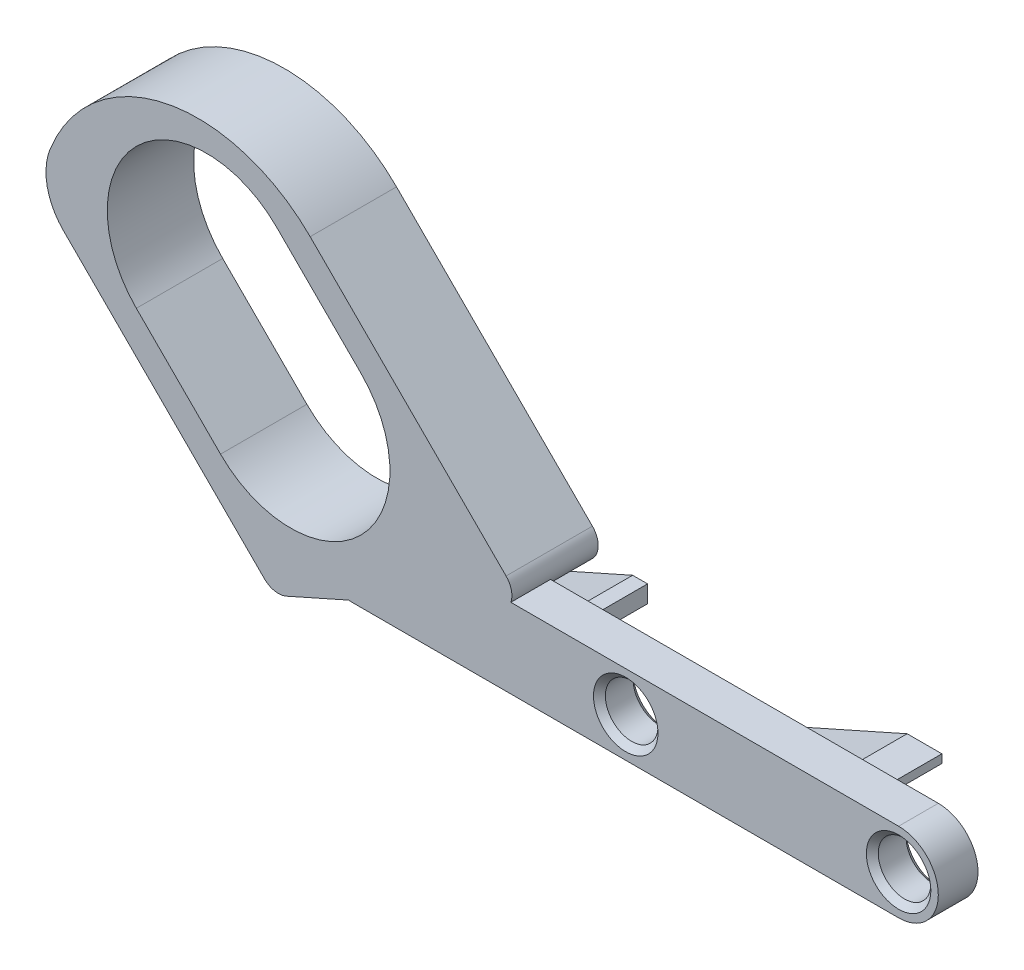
from build123d import *

# Parameters (mm, degrees)
BOSS_EXTRUDE1_DEPTH                      = 4
SKETCH2_R                                = 2.65
CUT_EXTRUDE1_DEPTH                       = 33.003906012
CHAMFER4_SIZE                            = 0.6
CHAMFER5_SIZE                            = 0.6
CHAMFER6_SIZE                            = 0.6
CHAMFER7_SIZE                            = 0.6
BOSS_EXTRUDE2_DEPTH                      = 4.7
MIRROR1_AT_THE_SECOND_PLANE_COPY_1_DEPTH = 4.7
CUT_EXTRUDE2_DEPTH                       = 4.7
BOSS_EXTRUDE3_START                      = -4.7
BOSS_EXTRUDE3_DEPTH                      = 8.7
SKETCH10_R                               = 10
CUT_EXTRUDE3_DEPTH                       = 8.7


with BuildPart() as part:
    # Sketch1 → Boss-Extrude1 (new body)
    with BuildSketch(Plane.XY):
        with BuildLine():
            Line((-27.5, 4), (27.5, 4))
            ThreePointArc((27.5, 4), (31.5, 0), (27.5, -4))
            Line((27.5, -4), (-27.5, -4))
            ThreePointArc((-27.5, -4), (-31.5, 0), (-27.5, 4))
        make_face()
    extrude(amount=BOSS_EXTRUDE1_DEPTH)

    # Sketch2 → Cut-Extrude1 (cut, through all)
    with BuildSketch(Plane.XY.offset(4)):
        Circle(SKETCH2_R)
        with Locations((27.5, 0)):
            Circle(SKETCH2_R)
    extrude(amount=-CUT_EXTRUDE1_DEPTH, mode=Mode.SUBTRACT)

    # Chamfer4
    chamfer4_edges = [part.edges().sort_by_distance(p)[0] for p in [
        (-2.65, 0, 0),
    ]]
    chamfer(chamfer4_edges, length=CHAMFER4_SIZE)

    # Chamfer5
    chamfer5_edges = [part.edges().sort_by_distance(p)[0] for p in [
        (-2.65, 0, 4),
    ]]
    chamfer(chamfer5_edges, length=CHAMFER5_SIZE)

    # Chamfer6
    chamfer6_edges = [part.edges().sort_by_distance(p)[0] for p in [
        (24.85, 0, 0),
    ]]
    chamfer(chamfer6_edges, length=CHAMFER6_SIZE)

    # Chamfer7
    chamfer7_edges = [part.edges().sort_by_distance(p)[0] for p in [
        (24.85, 0, 4),
    ]]
    chamfer(chamfer7_edges, length=CHAMFER7_SIZE)

    # Sketch5 → Boss-Extrude2 (add)
    with BuildSketch(Plane(origin=(0, 0, 0), x_dir=(-1, 0, 0), z_dir=(0, 0, -1))):
        Polygon((-23.160974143, 3.8), (-23.160974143, 2.950100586), (-8, -3.8), (-6.5, -3.8), (-6.5, -2.059643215), (-19.660974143, 3.8), align=None)
    boss_extrude2 = extrude(amount=BOSS_EXTRUDE2_DEPTH)

    # Mirror1: Boss-Extrude2 across plane
    add(boss_extrude2.mirror(Plane.ZX))

    # Mirror1 at the second plane: Boss-Extrude2 across plane
    add(boss_extrude2.mirror(Plane(origin=(0, 0, 0), x_dir=(0, 0, 1), z_dir=(1, 0, 0))))

    # Mirror1 at the second plane copy 1 sketc → Mirror1 at the second plane copy 1 (add)
    with BuildSketch(Plane(origin=(0, 0, 0), x_dir=(1, 0, 0), z_dir=(0, 0, -1))):
        Polygon((-23.160974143, 3.8), (-23.160974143, 2.950100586), (-8, -3.8), (-6.5, -3.8), (-6.5, -2.059643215), (-19.660974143, 3.8), align=None)
    extrude(amount=MIRROR1_AT_THE_SECOND_PLANE_COPY_1_DEPTH)

    # Sketch6 → Cut-Extrude2 (cut)
    with BuildSketch(Plane(origin=(0, 0, -4.7), x_dir=(-1, 0, 0), z_dir=(0, 0, -1))):
        Polygon((-15.104761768, 1.771443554), (-8.751545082, -1.057190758), (-4.110286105, 2.51311457), (-7.246807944, 7.601438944), align=None)
        Polygon((-17.626641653, 0.486057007), (-11.719631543, -2.143913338), (-16.648904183, -6.318754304), (-25.764538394, -5.234239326), (-21.9821284, -0.188886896), align=None)
        Polygon((8.58421018, 1.131693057), (14.703742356, -1.592898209), (6.44241206, -5.612978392), (4.525753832, -0.382775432), align=None)
        Polygon((11.983222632, 2.026555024), (17.758594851, -0.544806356), (24.258021, 3.436897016), (16.813955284, 7.91240132), align=None)
    extrude(amount=-CUT_EXTRUDE2_DEPTH, mode=Mode.SUBTRACT)

    # Sketch8 → Boss-Extrude3 (add)
    with BuildSketch(Plane.XY.offset(BOSS_EXTRUDE3_START)):
        with BuildLine():
            Line((-12.057693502, 6.057693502), (-31.799222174, 25.799222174))
            ThreePointArc((-31.799222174, 25.799222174), (-46.381884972, 30.148014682), (-58.00759919, 20.329215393))
            ThreePointArc((-58.00759919, 20.329215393), (-58.295536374, 16.911969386), (-56.664739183, 13.895186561))
            Line((-56.664739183, 13.895186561), (-36.413992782, -6.35555984))
            ThreePointArc((-36.413992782, -6.35555984), (-35.36425027, -6.907856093), (-34.186305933, -6.768437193))
            Line((-34.186305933, -6.768437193), (-12.658433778, 2.816389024))
            ThreePointArc((-12.658433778, 2.816389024), (-11.505397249, 4.279008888), (-12.057693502, 6.057693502))
        make_face()
        with BuildLine():
            Line((-40.832052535, 2.3051406), (-49.317333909, 10.790421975))
            ThreePointArc((-49.317333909, 10.790421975), (-49.317333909, 24.932557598), (-35.175198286, 24.932557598))
            Line((-35.175198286, 24.932557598), (-26.689916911, 16.447276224))
            ThreePointArc((-26.689916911, 16.447276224), (-26.689916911, 2.3051406), (-40.832052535, 2.3051406))
        make_face(mode=Mode.SUBTRACT)
    extrude(amount=BOSS_EXTRUDE3_DEPTH)

    # Sketch10 → Cut-Extrude3 (cut)
    with BuildSketch(Plane(origin=(0, 0, -4.7), x_dir=(-1, 0, 0), z_dir=(0, 0, -1))):
        with Locations((33.760984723, 9.376208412)):
            Circle(SKETCH10_R)
    extrude(amount=-CUT_EXTRUDE3_DEPTH, mode=Mode.SUBTRACT)


solid = part.part
